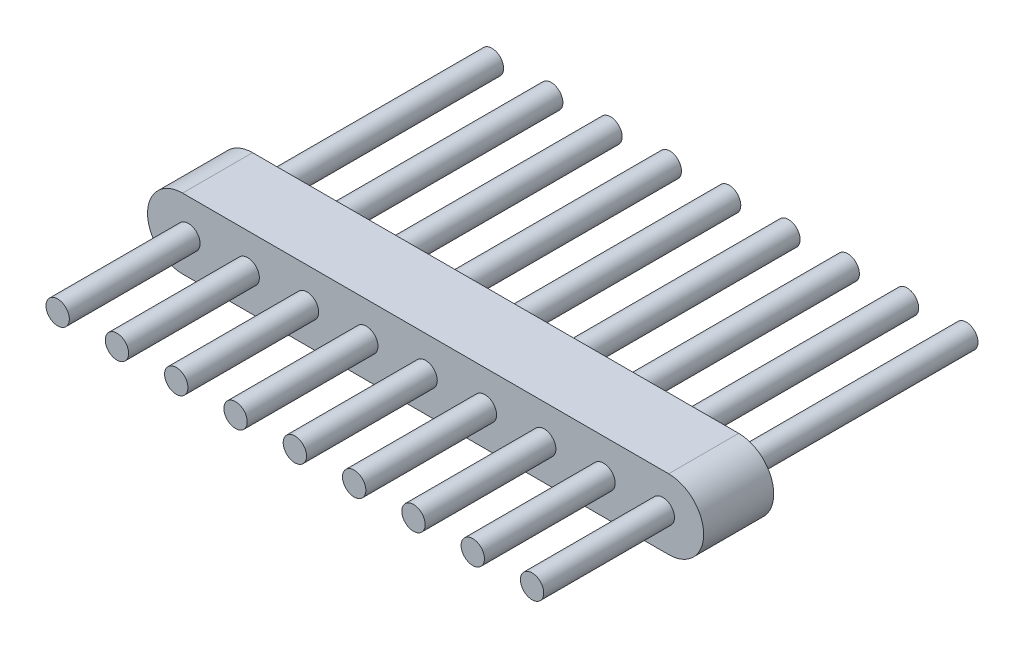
ISO-10303-21;
HEADER;
FILE_DESCRIPTION(('STEP AP214'),'2;1');
FILE_NAME('part.step','',(''),(''),'','','');
FILE_SCHEMA(('AUTOMOTIVE_DESIGN { 1 0 10303 214 1 1 1 1 }'));
ENDSEC;
DATA;
#1=APPLICATION_CONTEXT('core data for automotive mechanical design processes');
#2=APPLICATION_PROTOCOL_DEFINITION('international standard','automotive_design',2000,#1);
#3=PRODUCT_CONTEXT('',#1,'mechanical');
#4=PRODUCT('Part','Part','',(#3));
#5=PRODUCT_RELATED_PRODUCT_CATEGORY('part','',(#4));
#6=PRODUCT_DEFINITION_FORMATION('','',#4);
#7=PRODUCT_DEFINITION_CONTEXT('part definition',#1,'design');
#8=PRODUCT_DEFINITION('design','',#6,#7);
#9=PRODUCT_DEFINITION_SHAPE('','',#8);
#10=(LENGTH_UNIT() NAMED_UNIT(*) SI_UNIT(.MILLI.,.METRE.));
#11=(NAMED_UNIT(*) PLANE_ANGLE_UNIT() SI_UNIT($,.RADIAN.));
#12=(NAMED_UNIT(*) SI_UNIT($,.STERADIAN.) SOLID_ANGLE_UNIT());
#13=UNCERTAINTY_MEASURE_WITH_UNIT(LENGTH_MEASURE(1.E-05),#10,'distance_accuracy_value','');
#14=(GEOMETRIC_REPRESENTATION_CONTEXT(3) GLOBAL_UNCERTAINTY_ASSIGNED_CONTEXT((#13)) GLOBAL_UNIT_ASSIGNED_CONTEXT((#10,
#11,#12)) REPRESENTATION_CONTEXT('',''));
#15=CARTESIAN_POINT('',(0.,0.,0.));
#16=DIRECTION('',(0.,0.,1.));
#17=DIRECTION('',(1.,0.,0.));
#18=AXIS2_PLACEMENT_3D('',#15,#16,#17);
#19=CARTESIAN_POINT('',(125.878875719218,143.050518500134,0.));
#20=DIRECTION('',(0.,0.,1.));
#21=DIRECTION('',(1.,0.,0.));
#22=AXIS2_PLACEMENT_3D('',#19,#20,#21);
#23=PLANE('',#22);
#24=CARTESIAN_POINT('',(127.273875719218,143.050518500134,0.));
#25=DIRECTION('',(0.,0.,1.));
#26=DIRECTION('',(1.,0.,0.));
#27=AXIS2_PLACEMENT_3D('',#24,#25,#26);
#28=CIRCLE('',#27,0.250000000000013);
#29=CARTESIAN_POINT('',(127.523875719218,143.050518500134,0.));
#30=VERTEX_POINT('',#29);
#31=EDGE_CURVE('E44',#30,#30,#28,.F.);
#32=ORIENTED_EDGE('',*,*,#31,.F.);
#33=EDGE_LOOP('',(#32));
#34=FACE_BOUND('',#33,.T.);
#35=CARTESIAN_POINT('',(129.813875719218,143.050518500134,0.));
#36=DIRECTION('',(0.,0.,1.));
#37=DIRECTION('',(1.,0.,0.));
#38=AXIS2_PLACEMENT_3D('',#35,#36,#37);
#39=CIRCLE('',#38,0.250000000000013);
#40=CARTESIAN_POINT('',(130.063875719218,143.050518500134,0.));
#41=VERTEX_POINT('',#40);
#42=EDGE_CURVE('E129',#41,#41,#39,.F.);
#43=ORIENTED_EDGE('',*,*,#42,.F.);
#44=EDGE_LOOP('',(#43));
#45=FACE_BOUND('',#44,.T.);
#46=CARTESIAN_POINT('',(132.353875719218,143.050518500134,0.));
#47=DIRECTION('',(0.,0.,1.));
#48=DIRECTION('',(1.,0.,0.));
#49=AXIS2_PLACEMENT_3D('',#46,#47,#48);
#50=CIRCLE('',#49,0.250000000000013);
#51=CARTESIAN_POINT('',(132.603875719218,143.050518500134,0.));
#52=VERTEX_POINT('',#51);
#53=EDGE_CURVE('E123',#52,#52,#50,.F.);
#54=ORIENTED_EDGE('',*,*,#53,.F.);
#55=EDGE_LOOP('',(#54));
#56=FACE_BOUND('',#55,.T.);
#57=CARTESIAN_POINT('',(134.893875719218,143.050518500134,0.));
#58=DIRECTION('',(0.,0.,1.));
#59=DIRECTION('',(1.,0.,0.));
#60=AXIS2_PLACEMENT_3D('',#57,#58,#59);
#61=CIRCLE('',#60,0.249999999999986);
#62=CARTESIAN_POINT('',(135.143875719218,143.050518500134,0.));
#63=VERTEX_POINT('',#62);
#64=EDGE_CURVE('E117',#63,#63,#61,.F.);
#65=ORIENTED_EDGE('',*,*,#64,.F.);
#66=EDGE_LOOP('',(#65));
#67=FACE_BOUND('',#66,.T.);
#68=CARTESIAN_POINT('',(125.878875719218,143.050518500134,0.));
#69=DIRECTION('',(0.,0.,1.));
#70=DIRECTION('',(1.,0.,0.));
#71=AXIS2_PLACEMENT_3D('',#68,#69,#70);
#72=CIRCLE('',#71,0.750000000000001);
#73=CARTESIAN_POINT('',(125.878875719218,143.800518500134,0.));
#74=VERTEX_POINT('',#73);
#75=CARTESIAN_POINT('',(125.878875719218,142.300518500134,0.));
#76=VERTEX_POINT('',#75);
#77=EDGE_CURVE('E104',#74,#76,#72,.T.);
#78=ORIENTED_EDGE('',*,*,#77,.F.);
#79=DIRECTION('',(-1.,0.,0.));
#80=VECTOR('',#79,1.);
#81=CARTESIAN_POINT('',(125.878875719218,143.800518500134,0.));
#82=LINE('',#81,#80);
#83=CARTESIAN_POINT('',(136.288875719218,143.800518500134,0.));
#84=VERTEX_POINT('',#83);
#85=EDGE_CURVE('E75',#84,#74,#82,.T.);
#86=ORIENTED_EDGE('',*,*,#85,.F.);
#87=CARTESIAN_POINT('',(136.288875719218,143.050518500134,0.));
#88=DIRECTION('',(0.,0.,1.));
#89=DIRECTION('',(-1.,0.,0.));
#90=AXIS2_PLACEMENT_3D('',#87,#88,#89);
#91=CIRCLE('',#90,0.750000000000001);
#92=CARTESIAN_POINT('',(136.288875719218,142.300518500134,0.));
#93=VERTEX_POINT('',#92);
#94=EDGE_CURVE('E69',#93,#84,#91,.T.);
#95=ORIENTED_EDGE('',*,*,#94,.F.);
#96=DIRECTION('',(1.,0.,0.));
#97=VECTOR('',#96,1.);
#98=CARTESIAN_POINT('',(136.288875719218,142.300518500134,0.));
#99=LINE('',#98,#97);
#100=EDGE_CURVE('E94',#76,#93,#99,.T.);
#101=ORIENTED_EDGE('',*,*,#100,.F.);
#102=EDGE_LOOP('',(#78,#86,#95,#101));
#103=FACE_BOUND('',#102,.T.);
#104=CARTESIAN_POINT('',(136.163875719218,143.050518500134,0.));
#105=DIRECTION('',(0.,0.,1.));
#106=DIRECTION('',(1.,0.,0.));
#107=AXIS2_PLACEMENT_3D('',#104,#105,#106);
#108=CIRCLE('',#107,0.249999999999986);
#109=CARTESIAN_POINT('',(136.413875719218,143.050518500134,0.));
#110=VERTEX_POINT('',#109);
#111=EDGE_CURVE('E114',#110,#110,#108,.F.);
#112=ORIENTED_EDGE('',*,*,#111,.F.);
#113=EDGE_LOOP('',(#112));
#114=FACE_BOUND('',#113,.T.);
#115=CARTESIAN_POINT('',(133.623875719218,143.050518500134,0.));
#116=DIRECTION('',(0.,0.,1.));
#117=DIRECTION('',(1.,0.,0.));
#118=AXIS2_PLACEMENT_3D('',#115,#116,#117);
#119=CIRCLE('',#118,0.250000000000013);
#120=CARTESIAN_POINT('',(133.873875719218,143.050518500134,0.));
#121=VERTEX_POINT('',#120);
#122=EDGE_CURVE('E120',#121,#121,#119,.F.);
#123=ORIENTED_EDGE('',*,*,#122,.F.);
#124=EDGE_LOOP('',(#123));
#125=FACE_BOUND('',#124,.T.);
#126=CARTESIAN_POINT('',(131.083875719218,143.050518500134,0.));
#127=DIRECTION('',(0.,0.,1.));
#128=DIRECTION('',(1.,0.,0.));
#129=AXIS2_PLACEMENT_3D('',#126,#127,#128);
#130=CIRCLE('',#129,0.250000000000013);
#131=CARTESIAN_POINT('',(131.333875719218,143.050518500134,0.));
#132=VERTEX_POINT('',#131);
#133=EDGE_CURVE('E126',#132,#132,#130,.F.);
#134=ORIENTED_EDGE('',*,*,#133,.F.);
#135=EDGE_LOOP('',(#134));
#136=FACE_BOUND('',#135,.T.);
#137=CARTESIAN_POINT('',(128.543875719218,143.050518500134,0.));
#138=DIRECTION('',(0.,0.,1.));
#139=DIRECTION('',(1.,0.,0.));
#140=AXIS2_PLACEMENT_3D('',#137,#138,#139);
#141=CIRCLE('',#140,0.249999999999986);
#142=CARTESIAN_POINT('',(128.793875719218,143.050518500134,0.));
#143=VERTEX_POINT('',#142);
#144=EDGE_CURVE('E132',#143,#143,#141,.F.);
#145=ORIENTED_EDGE('',*,*,#144,.F.);
#146=EDGE_LOOP('',(#145));
#147=FACE_BOUND('',#146,.T.);
#148=CARTESIAN_POINT('',(126.003875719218,143.050518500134,0.));
#149=DIRECTION('',(0.,0.,1.));
#150=DIRECTION('',(1.,0.,0.));
#151=AXIS2_PLACEMENT_3D('',#148,#149,#150);
#152=CIRCLE('',#151,0.250000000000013);
#153=CARTESIAN_POINT('',(126.253875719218,143.050518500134,0.));
#154=VERTEX_POINT('',#153);
#155=EDGE_CURVE('E11',#154,#154,#152,.F.);
#156=ORIENTED_EDGE('',*,*,#155,.F.);
#157=EDGE_LOOP('',(#156));
#158=FACE_BOUND('',#157,.T.);
#159=ADVANCED_FACE('F35',(#34,#45,#56,#67,#103,#114,#125,#136,#147,#158),#23,.F.);
#160=CARTESIAN_POINT('',(125.878875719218,143.050518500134,1.5));
#161=DIRECTION('',(0.,0.,1.));
#162=DIRECTION('',(1.,0.,0.));
#163=AXIS2_PLACEMENT_3D('',#160,#161,#162);
#164=PLANE('',#163);
#165=CARTESIAN_POINT('',(134.893875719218,143.050518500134,1.5));
#166=DIRECTION('',(0.,0.,1.));
#167=DIRECTION('',(1.,0.,0.));
#168=AXIS2_PLACEMENT_3D('',#165,#166,#167);
#169=CIRCLE('',#168,0.250000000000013);
#170=CARTESIAN_POINT('',(135.143875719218,143.050518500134,1.5));
#171=VERTEX_POINT('',#170);
#172=EDGE_CURVE('E364',#171,#171,#169,.T.);
#173=ORIENTED_EDGE('',*,*,#172,.F.);
#174=EDGE_LOOP('',(#173));
#175=FACE_BOUND('',#174,.T.);
#176=CARTESIAN_POINT('',(132.353875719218,143.050518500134,1.5));
#177=DIRECTION('',(0.,0.,1.));
#178=DIRECTION('',(1.,0.,0.));
#179=AXIS2_PLACEMENT_3D('',#176,#177,#178);
#180=CIRCLE('',#179,0.250000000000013);
#181=CARTESIAN_POINT('',(132.603875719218,143.050518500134,1.5));
#182=VERTEX_POINT('',#181);
#183=EDGE_CURVE('E352',#182,#182,#180,.T.);
#184=ORIENTED_EDGE('',*,*,#183,.F.);
#185=EDGE_LOOP('',(#184));
#186=FACE_BOUND('',#185,.T.);
#187=CARTESIAN_POINT('',(129.813875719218,143.050518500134,1.5));
#188=DIRECTION('',(0.,0.,1.));
#189=DIRECTION('',(1.,0.,0.));
#190=AXIS2_PLACEMENT_3D('',#187,#188,#189);
#191=CIRCLE('',#190,0.249999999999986);
#192=CARTESIAN_POINT('',(130.063875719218,143.050518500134,1.5));
#193=VERTEX_POINT('',#192);
#194=EDGE_CURVE('E340',#193,#193,#191,.T.);
#195=ORIENTED_EDGE('',*,*,#194,.F.);
#196=EDGE_LOOP('',(#195));
#197=FACE_BOUND('',#196,.T.);
#198=CARTESIAN_POINT('',(127.273875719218,143.050518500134,1.5));
#199=DIRECTION('',(0.,0.,1.));
#200=DIRECTION('',(1.,0.,0.));
#201=AXIS2_PLACEMENT_3D('',#198,#199,#200);
#202=CIRCLE('',#201,0.250000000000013);
#203=CARTESIAN_POINT('',(127.523875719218,143.050518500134,1.5));
#204=VERTEX_POINT('',#203);
#205=EDGE_CURVE('E328',#204,#204,#202,.T.);
#206=ORIENTED_EDGE('',*,*,#205,.F.);
#207=EDGE_LOOP('',(#206));
#208=FACE_BOUND('',#207,.T.);
#209=CARTESIAN_POINT('',(125.878875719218,143.050518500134,1.5));
#210=DIRECTION('',(0.,0.,1.));
#211=DIRECTION('',(1.,0.,0.));
#212=AXIS2_PLACEMENT_3D('',#209,#210,#211);
#213=CIRCLE('',#212,0.750000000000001);
#214=CARTESIAN_POINT('',(125.878875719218,143.800518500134,1.5));
#215=VERTEX_POINT('',#214);
#216=CARTESIAN_POINT('',(125.878875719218,142.300518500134,1.5));
#217=VERTEX_POINT('',#216);
#218=EDGE_CURVE('E89',#215,#217,#213,.T.);
#219=ORIENTED_EDGE('',*,*,#218,.T.);
#220=DIRECTION('',(1.,0.,0.));
#221=VECTOR('',#220,1.);
#222=CARTESIAN_POINT('',(136.288875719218,142.300518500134,1.5));
#223=LINE('',#222,#221);
#224=CARTESIAN_POINT('',(136.288875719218,142.300518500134,1.5));
#225=VERTEX_POINT('',#224);
#226=EDGE_CURVE('E83',#217,#225,#223,.T.);
#227=ORIENTED_EDGE('',*,*,#226,.T.);
#228=CARTESIAN_POINT('',(136.288875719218,143.050518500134,1.5));
#229=DIRECTION('',(0.,0.,1.));
#230=DIRECTION('',(-1.,0.,0.));
#231=AXIS2_PLACEMENT_3D('',#228,#229,#230);
#232=CIRCLE('',#231,0.750000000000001);
#233=CARTESIAN_POINT('',(136.288875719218,143.800518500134,1.5));
#234=VERTEX_POINT('',#233);
#235=EDGE_CURVE('E87',#225,#234,#232,.T.);
#236=ORIENTED_EDGE('',*,*,#235,.T.);
#237=DIRECTION('',(-1.,0.,0.));
#238=VECTOR('',#237,1.);
#239=CARTESIAN_POINT('',(125.878875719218,143.800518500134,1.5));
#240=LINE('',#239,#238);
#241=EDGE_CURVE('E52',#234,#215,#240,.T.);
#242=ORIENTED_EDGE('',*,*,#241,.T.);
#243=EDGE_LOOP('',(#219,#227,#236,#242));
#244=FACE_BOUND('',#243,.T.);
#245=CARTESIAN_POINT('',(126.003875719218,143.050518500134,1.5));
#246=DIRECTION('',(0.,0.,1.));
#247=DIRECTION('',(1.,0.,0.));
#248=AXIS2_PLACEMENT_3D('',#245,#246,#247);
#249=CIRCLE('',#248,0.249999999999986);
#250=CARTESIAN_POINT('',(126.253875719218,143.050518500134,1.5));
#251=VERTEX_POINT('',#250);
#252=EDGE_CURVE('E322',#251,#251,#249,.T.);
#253=ORIENTED_EDGE('',*,*,#252,.F.);
#254=EDGE_LOOP('',(#253));
#255=FACE_BOUND('',#254,.T.);
#256=CARTESIAN_POINT('',(128.543875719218,143.050518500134,1.5));
#257=DIRECTION('',(0.,0.,1.));
#258=DIRECTION('',(1.,0.,0.));
#259=AXIS2_PLACEMENT_3D('',#256,#257,#258);
#260=CIRCLE('',#259,0.24999999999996);
#261=CARTESIAN_POINT('',(128.793875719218,143.050518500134,1.5));
#262=VERTEX_POINT('',#261);
#263=EDGE_CURVE('E334',#262,#262,#260,.T.);
#264=ORIENTED_EDGE('',*,*,#263,.F.);
#265=EDGE_LOOP('',(#264));
#266=FACE_BOUND('',#265,.T.);
#267=CARTESIAN_POINT('',(131.083875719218,143.050518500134,1.5));
#268=DIRECTION('',(0.,0.,1.));
#269=DIRECTION('',(1.,0.,0.));
#270=AXIS2_PLACEMENT_3D('',#267,#268,#269);
#271=CIRCLE('',#270,0.249999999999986);
#272=CARTESIAN_POINT('',(131.333875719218,143.050518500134,1.5));
#273=VERTEX_POINT('',#272);
#274=EDGE_CURVE('E346',#273,#273,#271,.T.);
#275=ORIENTED_EDGE('',*,*,#274,.F.);
#276=EDGE_LOOP('',(#275));
#277=FACE_BOUND('',#276,.T.);
#278=CARTESIAN_POINT('',(133.623875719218,143.050518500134,1.5));
#279=DIRECTION('',(0.,0.,1.));
#280=DIRECTION('',(1.,0.,0.));
#281=AXIS2_PLACEMENT_3D('',#278,#279,#280);
#282=CIRCLE('',#281,0.250000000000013);
#283=CARTESIAN_POINT('',(133.873875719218,143.050518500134,1.5));
#284=VERTEX_POINT('',#283);
#285=EDGE_CURVE('E358',#284,#284,#282,.T.);
#286=ORIENTED_EDGE('',*,*,#285,.F.);
#287=EDGE_LOOP('',(#286));
#288=FACE_BOUND('',#287,.T.);
#289=CARTESIAN_POINT('',(136.163875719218,143.050518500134,1.5));
#290=DIRECTION('',(0.,0.,1.));
#291=DIRECTION('',(1.,0.,0.));
#292=AXIS2_PLACEMENT_3D('',#289,#290,#291);
#293=CIRCLE('',#292,0.249999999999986);
#294=CARTESIAN_POINT('',(136.413875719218,143.050518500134,1.5));
#295=VERTEX_POINT('',#294);
#296=EDGE_CURVE('E370',#295,#295,#293,.T.);
#297=ORIENTED_EDGE('',*,*,#296,.F.);
#298=EDGE_LOOP('',(#297));
#299=FACE_BOUND('',#298,.T.);
#300=ADVANCED_FACE('F84',(#175,#186,#197,#208,#244,#255,#266,#277,#288,#299),#164,.T.);
#301=CARTESIAN_POINT('',(125.878875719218,143.050518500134,1.5));
#302=DIRECTION('',(0.,0.,-1.));
#303=DIRECTION('',(-1.,0.,0.));
#304=AXIS2_PLACEMENT_3D('',#301,#302,#303);
#305=CYLINDRICAL_SURFACE('',#304,0.750000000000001);
#306=ORIENTED_EDGE('',*,*,#77,.T.);
#307=DIRECTION('',(0.,0.,-1.));
#308=VECTOR('',#307,1.);
#309=CARTESIAN_POINT('',(125.878875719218,142.300518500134,1.5));
#310=LINE('',#309,#308);
#311=EDGE_CURVE('E95',#217,#76,#310,.T.);
#312=ORIENTED_EDGE('',*,*,#311,.F.);
#313=ORIENTED_EDGE('',*,*,#218,.F.);
#314=DIRECTION('',(0.,0.,-1.));
#315=VECTOR('',#314,1.);
#316=CARTESIAN_POINT('',(125.878875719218,143.800518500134,1.5));
#317=LINE('',#316,#315);
#318=EDGE_CURVE('E100',#215,#74,#317,.T.);
#319=ORIENTED_EDGE('',*,*,#318,.T.);
#320=EDGE_LOOP('',(#306,#312,#313,#319));
#321=FACE_BOUND('',#320,.T.);
#322=ADVANCED_FACE('F37',(#321),#305,.T.);
#323=CARTESIAN_POINT('',(136.288875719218,142.300518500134,1.5));
#324=DIRECTION('',(0.,1.,0.));
#325=DIRECTION('',(0.,0.,1.));
#326=AXIS2_PLACEMENT_3D('',#323,#324,#325);
#327=PLANE('',#326);
#328=ORIENTED_EDGE('',*,*,#100,.T.);
#329=DIRECTION('',(0.,0.,-1.));
#330=VECTOR('',#329,1.);
#331=CARTESIAN_POINT('',(136.288875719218,142.300518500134,1.5));
#332=LINE('',#331,#330);
#333=EDGE_CURVE('E92',#225,#93,#332,.T.);
#334=ORIENTED_EDGE('',*,*,#333,.F.);
#335=ORIENTED_EDGE('',*,*,#226,.F.);
#336=ORIENTED_EDGE('',*,*,#311,.T.);
#337=EDGE_LOOP('',(#328,#334,#335,#336));
#338=FACE_BOUND('',#337,.T.);
#339=ADVANCED_FACE('F93',(#338),#327,.F.);
#340=CARTESIAN_POINT('',(136.288875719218,143.050518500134,1.5));
#341=DIRECTION('',(0.,0.,-1.));
#342=DIRECTION('',(-1.,0.,0.));
#343=AXIS2_PLACEMENT_3D('',#340,#341,#342);
#344=CYLINDRICAL_SURFACE('',#343,0.750000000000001);
#345=ORIENTED_EDGE('',*,*,#94,.T.);
#346=DIRECTION('',(0.,0.,-1.));
#347=VECTOR('',#346,1.);
#348=CARTESIAN_POINT('',(136.288875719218,143.800518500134,1.5));
#349=LINE('',#348,#347);
#350=EDGE_CURVE('E96',#234,#84,#349,.T.);
#351=ORIENTED_EDGE('',*,*,#350,.F.);
#352=ORIENTED_EDGE('',*,*,#235,.F.);
#353=ORIENTED_EDGE('',*,*,#333,.T.);
#354=EDGE_LOOP('',(#345,#351,#352,#353));
#355=FACE_BOUND('',#354,.T.);
#356=ADVANCED_FACE('F98',(#355),#344,.T.);
#357=CARTESIAN_POINT('',(125.878875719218,143.800518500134,1.5));
#358=DIRECTION('',(0.,-1.,0.));
#359=DIRECTION('',(0.,0.,-1.));
#360=AXIS2_PLACEMENT_3D('',#357,#358,#359);
#361=PLANE('',#360);
#362=ORIENTED_EDGE('',*,*,#85,.T.);
#363=ORIENTED_EDGE('',*,*,#318,.F.);
#364=ORIENTED_EDGE('',*,*,#241,.F.);
#365=ORIENTED_EDGE('',*,*,#350,.T.);
#366=EDGE_LOOP('',(#362,#363,#364,#365));
#367=FACE_BOUND('',#366,.T.);
#368=ADVANCED_FACE('F306',(#367),#361,.F.);
#369=CARTESIAN_POINT('',(126.003875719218,143.050518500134,4.3));
#370=DIRECTION('',(0.,0.,-1.));
#371=DIRECTION('',(-1.,0.,0.));
#372=AXIS2_PLACEMENT_3D('',#369,#370,#371);
#373=CYLINDRICAL_SURFACE('',#372,0.249999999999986);
#374=CARTESIAN_POINT('',(126.003875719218,143.050518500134,4.3));
#375=DIRECTION('',(0.,0.,1.));
#376=DIRECTION('',(1.,0.,0.));
#377=AXIS2_PLACEMENT_3D('',#374,#375,#376);
#378=CIRCLE('',#377,0.249999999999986);
#379=CARTESIAN_POINT('',(126.253875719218,143.050518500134,4.3));
#380=VERTEX_POINT('',#379);
#381=EDGE_CURVE('E107',#380,#380,#378,.T.);
#382=ORIENTED_EDGE('',*,*,#381,.F.);
#383=EDGE_LOOP('',(#382));
#384=FACE_BOUND('',#383,.T.);
#385=ORIENTED_EDGE('',*,*,#252,.T.);
#386=EDGE_LOOP('',(#385));
#387=FACE_BOUND('',#386,.T.);
#388=ADVANCED_FACE('F302',(#384,#387),#373,.T.);
#389=CARTESIAN_POINT('',(126.003875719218,143.050518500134,4.3));
#390=DIRECTION('',(0.,0.,1.));
#391=DIRECTION('',(1.,0.,0.));
#392=AXIS2_PLACEMENT_3D('',#389,#390,#391);
#393=PLANE('',#392);
#394=ORIENTED_EDGE('',*,*,#381,.T.);
#395=EDGE_LOOP('',(#394));
#396=FACE_BOUND('',#395,.T.);
#397=ADVANCED_FACE('F298',(#396),#393,.T.);
#398=CARTESIAN_POINT('',(127.273875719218,143.050518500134,4.3));
#399=DIRECTION('',(0.,0.,-1.));
#400=DIRECTION('',(-1.,0.,0.));
#401=AXIS2_PLACEMENT_3D('',#398,#399,#400);
#402=CYLINDRICAL_SURFACE('',#401,0.250000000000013);
#403=CARTESIAN_POINT('',(127.273875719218,143.050518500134,4.3));
#404=DIRECTION('',(0.,0.,1.));
#405=DIRECTION('',(1.,0.,0.));
#406=AXIS2_PLACEMENT_3D('',#403,#404,#405);
#407=CIRCLE('',#406,0.250000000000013);
#408=CARTESIAN_POINT('',(127.523875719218,143.050518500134,4.3));
#409=VERTEX_POINT('',#408);
#410=EDGE_CURVE('E325',#409,#409,#407,.T.);
#411=ORIENTED_EDGE('',*,*,#410,.F.);
#412=EDGE_LOOP('',(#411));
#413=FACE_BOUND('',#412,.T.);
#414=ORIENTED_EDGE('',*,*,#205,.T.);
#415=EDGE_LOOP('',(#414));
#416=FACE_BOUND('',#415,.T.);
#417=ADVANCED_FACE('F294',(#413,#416),#402,.T.);
#418=CARTESIAN_POINT('',(127.273875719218,143.050518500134,4.3));
#419=DIRECTION('',(0.,0.,1.));
#420=DIRECTION('',(1.,0.,0.));
#421=AXIS2_PLACEMENT_3D('',#418,#419,#420);
#422=PLANE('',#421);
#423=ORIENTED_EDGE('',*,*,#410,.T.);
#424=EDGE_LOOP('',(#423));
#425=FACE_BOUND('',#424,.T.);
#426=ADVANCED_FACE('F290',(#425),#422,.T.);
#427=CARTESIAN_POINT('',(128.543875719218,143.050518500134,4.3));
#428=DIRECTION('',(0.,0.,-1.));
#429=DIRECTION('',(-1.,0.,0.));
#430=AXIS2_PLACEMENT_3D('',#427,#428,#429);
#431=CYLINDRICAL_SURFACE('',#430,0.24999999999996);
#432=CARTESIAN_POINT('',(128.543875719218,143.050518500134,4.3));
#433=DIRECTION('',(0.,0.,1.));
#434=DIRECTION('',(1.,0.,0.));
#435=AXIS2_PLACEMENT_3D('',#432,#433,#434);
#436=CIRCLE('',#435,0.24999999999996);
#437=CARTESIAN_POINT('',(128.793875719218,143.050518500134,4.3));
#438=VERTEX_POINT('',#437);
#439=EDGE_CURVE('E331',#438,#438,#436,.T.);
#440=ORIENTED_EDGE('',*,*,#439,.F.);
#441=EDGE_LOOP('',(#440));
#442=FACE_BOUND('',#441,.T.);
#443=ORIENTED_EDGE('',*,*,#263,.T.);
#444=EDGE_LOOP('',(#443));
#445=FACE_BOUND('',#444,.T.);
#446=ADVANCED_FACE('F286',(#442,#445),#431,.T.);
#447=CARTESIAN_POINT('',(128.543875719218,143.050518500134,4.3));
#448=DIRECTION('',(0.,0.,1.));
#449=DIRECTION('',(1.,0.,0.));
#450=AXIS2_PLACEMENT_3D('',#447,#448,#449);
#451=PLANE('',#450);
#452=ORIENTED_EDGE('',*,*,#439,.T.);
#453=EDGE_LOOP('',(#452));
#454=FACE_BOUND('',#453,.T.);
#455=ADVANCED_FACE('F282',(#454),#451,.T.);
#456=CARTESIAN_POINT('',(129.813875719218,143.050518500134,4.3));
#457=DIRECTION('',(0.,0.,-1.));
#458=DIRECTION('',(-1.,0.,0.));
#459=AXIS2_PLACEMENT_3D('',#456,#457,#458);
#460=CYLINDRICAL_SURFACE('',#459,0.249999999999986);
#461=CARTESIAN_POINT('',(129.813875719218,143.050518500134,4.3));
#462=DIRECTION('',(0.,0.,1.));
#463=DIRECTION('',(1.,0.,0.));
#464=AXIS2_PLACEMENT_3D('',#461,#462,#463);
#465=CIRCLE('',#464,0.249999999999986);
#466=CARTESIAN_POINT('',(130.063875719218,143.050518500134,4.3));
#467=VERTEX_POINT('',#466);
#468=EDGE_CURVE('E337',#467,#467,#465,.T.);
#469=ORIENTED_EDGE('',*,*,#468,.F.);
#470=EDGE_LOOP('',(#469));
#471=FACE_BOUND('',#470,.T.);
#472=ORIENTED_EDGE('',*,*,#194,.T.);
#473=EDGE_LOOP('',(#472));
#474=FACE_BOUND('',#473,.T.);
#475=ADVANCED_FACE('F278',(#471,#474),#460,.T.);
#476=CARTESIAN_POINT('',(129.813875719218,143.050518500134,4.3));
#477=DIRECTION('',(0.,0.,1.));
#478=DIRECTION('',(1.,0.,0.));
#479=AXIS2_PLACEMENT_3D('',#476,#477,#478);
#480=PLANE('',#479);
#481=ORIENTED_EDGE('',*,*,#468,.T.);
#482=EDGE_LOOP('',(#481));
#483=FACE_BOUND('',#482,.T.);
#484=ADVANCED_FACE('F274',(#483),#480,.T.);
#485=CARTESIAN_POINT('',(131.083875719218,143.050518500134,4.3));
#486=DIRECTION('',(0.,0.,-1.));
#487=DIRECTION('',(-1.,0.,0.));
#488=AXIS2_PLACEMENT_3D('',#485,#486,#487);
#489=CYLINDRICAL_SURFACE('',#488,0.249999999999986);
#490=CARTESIAN_POINT('',(131.083875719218,143.050518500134,4.3));
#491=DIRECTION('',(0.,0.,1.));
#492=DIRECTION('',(1.,0.,0.));
#493=AXIS2_PLACEMENT_3D('',#490,#491,#492);
#494=CIRCLE('',#493,0.249999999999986);
#495=CARTESIAN_POINT('',(131.333875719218,143.050518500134,4.3));
#496=VERTEX_POINT('',#495);
#497=EDGE_CURVE('E343',#496,#496,#494,.T.);
#498=ORIENTED_EDGE('',*,*,#497,.F.);
#499=EDGE_LOOP('',(#498));
#500=FACE_BOUND('',#499,.T.);
#501=ORIENTED_EDGE('',*,*,#274,.T.);
#502=EDGE_LOOP('',(#501));
#503=FACE_BOUND('',#502,.T.);
#504=ADVANCED_FACE('F270',(#500,#503),#489,.T.);
#505=CARTESIAN_POINT('',(131.083875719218,143.050518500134,4.3));
#506=DIRECTION('',(0.,0.,1.));
#507=DIRECTION('',(1.,0.,0.));
#508=AXIS2_PLACEMENT_3D('',#505,#506,#507);
#509=PLANE('',#508);
#510=ORIENTED_EDGE('',*,*,#497,.T.);
#511=EDGE_LOOP('',(#510));
#512=FACE_BOUND('',#511,.T.);
#513=ADVANCED_FACE('F266',(#512),#509,.T.);
#514=CARTESIAN_POINT('',(132.353875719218,143.050518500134,4.3));
#515=DIRECTION('',(0.,0.,-1.));
#516=DIRECTION('',(-1.,0.,0.));
#517=AXIS2_PLACEMENT_3D('',#514,#515,#516);
#518=CYLINDRICAL_SURFACE('',#517,0.250000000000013);
#519=CARTESIAN_POINT('',(132.353875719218,143.050518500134,4.3));
#520=DIRECTION('',(0.,0.,1.));
#521=DIRECTION('',(1.,0.,0.));
#522=AXIS2_PLACEMENT_3D('',#519,#520,#521);
#523=CIRCLE('',#522,0.250000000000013);
#524=CARTESIAN_POINT('',(132.603875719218,143.050518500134,4.3));
#525=VERTEX_POINT('',#524);
#526=EDGE_CURVE('E349',#525,#525,#523,.T.);
#527=ORIENTED_EDGE('',*,*,#526,.F.);
#528=EDGE_LOOP('',(#527));
#529=FACE_BOUND('',#528,.T.);
#530=ORIENTED_EDGE('',*,*,#183,.T.);
#531=EDGE_LOOP('',(#530));
#532=FACE_BOUND('',#531,.T.);
#533=ADVANCED_FACE('F262',(#529,#532),#518,.T.);
#534=CARTESIAN_POINT('',(132.353875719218,143.050518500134,4.3));
#535=DIRECTION('',(0.,0.,1.));
#536=DIRECTION('',(1.,0.,0.));
#537=AXIS2_PLACEMENT_3D('',#534,#535,#536);
#538=PLANE('',#537);
#539=ORIENTED_EDGE('',*,*,#526,.T.);
#540=EDGE_LOOP('',(#539));
#541=FACE_BOUND('',#540,.T.);
#542=ADVANCED_FACE('F258',(#541),#538,.T.);
#543=CARTESIAN_POINT('',(133.623875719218,143.050518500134,4.3));
#544=DIRECTION('',(0.,0.,-1.));
#545=DIRECTION('',(-1.,0.,0.));
#546=AXIS2_PLACEMENT_3D('',#543,#544,#545);
#547=CYLINDRICAL_SURFACE('',#546,0.250000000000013);
#548=CARTESIAN_POINT('',(133.623875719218,143.050518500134,4.3));
#549=DIRECTION('',(0.,0.,1.));
#550=DIRECTION('',(1.,0.,0.));
#551=AXIS2_PLACEMENT_3D('',#548,#549,#550);
#552=CIRCLE('',#551,0.250000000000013);
#553=CARTESIAN_POINT('',(133.873875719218,143.050518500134,4.3));
#554=VERTEX_POINT('',#553);
#555=EDGE_CURVE('E355',#554,#554,#552,.T.);
#556=ORIENTED_EDGE('',*,*,#555,.F.);
#557=EDGE_LOOP('',(#556));
#558=FACE_BOUND('',#557,.T.);
#559=ORIENTED_EDGE('',*,*,#285,.T.);
#560=EDGE_LOOP('',(#559));
#561=FACE_BOUND('',#560,.T.);
#562=ADVANCED_FACE('F254',(#558,#561),#547,.T.);
#563=CARTESIAN_POINT('',(133.623875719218,143.050518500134,4.3));
#564=DIRECTION('',(0.,0.,1.));
#565=DIRECTION('',(1.,0.,0.));
#566=AXIS2_PLACEMENT_3D('',#563,#564,#565);
#567=PLANE('',#566);
#568=ORIENTED_EDGE('',*,*,#555,.T.);
#569=EDGE_LOOP('',(#568));
#570=FACE_BOUND('',#569,.T.);
#571=ADVANCED_FACE('F250',(#570),#567,.T.);
#572=CARTESIAN_POINT('',(134.893875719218,143.050518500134,4.3));
#573=DIRECTION('',(0.,0.,-1.));
#574=DIRECTION('',(-1.,0.,0.));
#575=AXIS2_PLACEMENT_3D('',#572,#573,#574);
#576=CYLINDRICAL_SURFACE('',#575,0.250000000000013);
#577=CARTESIAN_POINT('',(134.893875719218,143.050518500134,4.3));
#578=DIRECTION('',(0.,0.,1.));
#579=DIRECTION('',(1.,0.,0.));
#580=AXIS2_PLACEMENT_3D('',#577,#578,#579);
#581=CIRCLE('',#580,0.250000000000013);
#582=CARTESIAN_POINT('',(135.143875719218,143.050518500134,4.3));
#583=VERTEX_POINT('',#582);
#584=EDGE_CURVE('E361',#583,#583,#581,.T.);
#585=ORIENTED_EDGE('',*,*,#584,.F.);
#586=EDGE_LOOP('',(#585));
#587=FACE_BOUND('',#586,.T.);
#588=ORIENTED_EDGE('',*,*,#172,.T.);
#589=EDGE_LOOP('',(#588));
#590=FACE_BOUND('',#589,.T.);
#591=ADVANCED_FACE('F246',(#587,#590),#576,.T.);
#592=CARTESIAN_POINT('',(134.893875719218,143.050518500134,4.3));
#593=DIRECTION('',(0.,0.,1.));
#594=DIRECTION('',(1.,0.,0.));
#595=AXIS2_PLACEMENT_3D('',#592,#593,#594);
#596=PLANE('',#595);
#597=ORIENTED_EDGE('',*,*,#584,.T.);
#598=EDGE_LOOP('',(#597));
#599=FACE_BOUND('',#598,.T.);
#600=ADVANCED_FACE('F242',(#599),#596,.T.);
#601=CARTESIAN_POINT('',(136.163875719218,143.050518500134,4.3));
#602=DIRECTION('',(0.,0.,-1.));
#603=DIRECTION('',(-1.,0.,0.));
#604=AXIS2_PLACEMENT_3D('',#601,#602,#603);
#605=CYLINDRICAL_SURFACE('',#604,0.249999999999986);
#606=CARTESIAN_POINT('',(136.163875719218,143.050518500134,4.3));
#607=DIRECTION('',(0.,0.,1.));
#608=DIRECTION('',(1.,0.,0.));
#609=AXIS2_PLACEMENT_3D('',#606,#607,#608);
#610=CIRCLE('',#609,0.249999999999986);
#611=CARTESIAN_POINT('',(136.413875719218,143.050518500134,4.3));
#612=VERTEX_POINT('',#611);
#613=EDGE_CURVE('E367',#612,#612,#610,.T.);
#614=ORIENTED_EDGE('',*,*,#613,.F.);
#615=EDGE_LOOP('',(#614));
#616=FACE_BOUND('',#615,.T.);
#617=ORIENTED_EDGE('',*,*,#296,.T.);
#618=EDGE_LOOP('',(#617));
#619=FACE_BOUND('',#618,.T.);
#620=ADVANCED_FACE('F238',(#616,#619),#605,.T.);
#621=CARTESIAN_POINT('',(136.163875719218,143.050518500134,4.3));
#622=DIRECTION('',(0.,0.,1.));
#623=DIRECTION('',(1.,0.,0.));
#624=AXIS2_PLACEMENT_3D('',#621,#622,#623);
#625=PLANE('',#624);
#626=ORIENTED_EDGE('',*,*,#613,.T.);
#627=EDGE_LOOP('',(#626));
#628=FACE_BOUND('',#627,.T.);
#629=ADVANCED_FACE('F234',(#628),#625,.T.);
#630=CARTESIAN_POINT('',(136.163875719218,143.050518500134,-5.));
#631=DIRECTION('',(0.,0.,1.));
#632=DIRECTION('',(1.,0.,0.));
#633=AXIS2_PLACEMENT_3D('',#630,#631,#632);
#634=CYLINDRICAL_SURFACE('',#633,0.249999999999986);
#635=CARTESIAN_POINT('',(136.163875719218,143.050518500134,-5.));
#636=DIRECTION('',(0.,0.,-1.));
#637=DIRECTION('',(-1.,0.,0.));
#638=AXIS2_PLACEMENT_3D('',#635,#636,#637);
#639=CIRCLE('',#638,0.249999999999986);
#640=CARTESIAN_POINT('',(135.913875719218,143.050518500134,-5.));
#641=VERTEX_POINT('',#640);
#642=EDGE_CURVE('E373',#641,#641,#639,.T.);
#643=ORIENTED_EDGE('',*,*,#642,.F.);
#644=EDGE_LOOP('',(#643));
#645=FACE_BOUND('',#644,.T.);
#646=ORIENTED_EDGE('',*,*,#111,.T.);
#647=EDGE_LOOP('',(#646));
#648=FACE_BOUND('',#647,.T.);
#649=ADVANCED_FACE('F230',(#645,#648),#634,.T.);
#650=CARTESIAN_POINT('',(136.163875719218,143.050518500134,-5.));
#651=DIRECTION('',(0.,0.,-1.));
#652=DIRECTION('',(-1.,0.,0.));
#653=AXIS2_PLACEMENT_3D('',#650,#651,#652);
#654=PLANE('',#653);
#655=ORIENTED_EDGE('',*,*,#642,.T.);
#656=EDGE_LOOP('',(#655));
#657=FACE_BOUND('',#656,.T.);
#658=ADVANCED_FACE('F226',(#657),#654,.T.);
#659=CARTESIAN_POINT('',(134.893875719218,143.050518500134,-5.));
#660=DIRECTION('',(0.,0.,1.));
#661=DIRECTION('',(1.,0.,0.));
#662=AXIS2_PLACEMENT_3D('',#659,#660,#661);
#663=CYLINDRICAL_SURFACE('',#662,0.249999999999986);
#664=CARTESIAN_POINT('',(134.893875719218,143.050518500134,-5.));
#665=DIRECTION('',(0.,0.,-1.));
#666=DIRECTION('',(-1.,0.,0.));
#667=AXIS2_PLACEMENT_3D('',#664,#665,#666);
#668=CIRCLE('',#667,0.249999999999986);
#669=CARTESIAN_POINT('',(134.643875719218,143.050518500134,-5.));
#670=VERTEX_POINT('',#669);
#671=EDGE_CURVE('E378',#670,#670,#668,.T.);
#672=ORIENTED_EDGE('',*,*,#671,.F.);
#673=EDGE_LOOP('',(#672));
#674=FACE_BOUND('',#673,.T.);
#675=ORIENTED_EDGE('',*,*,#64,.T.);
#676=EDGE_LOOP('',(#675));
#677=FACE_BOUND('',#676,.T.);
#678=ADVANCED_FACE('F222',(#674,#677),#663,.T.);
#679=CARTESIAN_POINT('',(134.893875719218,143.050518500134,-5.));
#680=DIRECTION('',(0.,0.,-1.));
#681=DIRECTION('',(-1.,0.,0.));
#682=AXIS2_PLACEMENT_3D('',#679,#680,#681);
#683=PLANE('',#682);
#684=ORIENTED_EDGE('',*,*,#671,.T.);
#685=EDGE_LOOP('',(#684));
#686=FACE_BOUND('',#685,.T.);
#687=ADVANCED_FACE('F218',(#686),#683,.T.);
#688=CARTESIAN_POINT('',(133.623875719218,143.050518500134,-5.));
#689=DIRECTION('',(0.,0.,1.));
#690=DIRECTION('',(1.,0.,0.));
#691=AXIS2_PLACEMENT_3D('',#688,#689,#690);
#692=CYLINDRICAL_SURFACE('',#691,0.250000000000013);
#693=CARTESIAN_POINT('',(133.623875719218,143.050518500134,-5.));
#694=DIRECTION('',(0.,0.,-1.));
#695=DIRECTION('',(-1.,0.,0.));
#696=AXIS2_PLACEMENT_3D('',#693,#694,#695);
#697=CIRCLE('',#696,0.250000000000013);
#698=CARTESIAN_POINT('',(133.373875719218,143.050518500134,-5.));
#699=VERTEX_POINT('',#698);
#700=EDGE_CURVE('E381',#699,#699,#697,.T.);
#701=ORIENTED_EDGE('',*,*,#700,.F.);
#702=EDGE_LOOP('',(#701));
#703=FACE_BOUND('',#702,.T.);
#704=ORIENTED_EDGE('',*,*,#122,.T.);
#705=EDGE_LOOP('',(#704));
#706=FACE_BOUND('',#705,.T.);
#707=ADVANCED_FACE('F214',(#703,#706),#692,.T.);
#708=CARTESIAN_POINT('',(133.623875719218,143.050518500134,-5.));
#709=DIRECTION('',(0.,0.,-1.));
#710=DIRECTION('',(-1.,0.,0.));
#711=AXIS2_PLACEMENT_3D('',#708,#709,#710);
#712=PLANE('',#711);
#713=ORIENTED_EDGE('',*,*,#700,.T.);
#714=EDGE_LOOP('',(#713));
#715=FACE_BOUND('',#714,.T.);
#716=ADVANCED_FACE('F210',(#715),#712,.T.);
#717=CARTESIAN_POINT('',(132.353875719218,143.050518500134,-5.));
#718=DIRECTION('',(0.,0.,1.));
#719=DIRECTION('',(1.,0.,0.));
#720=AXIS2_PLACEMENT_3D('',#717,#718,#719);
#721=CYLINDRICAL_SURFACE('',#720,0.250000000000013);
#722=CARTESIAN_POINT('',(132.353875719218,143.050518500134,-5.));
#723=DIRECTION('',(0.,0.,-1.));
#724=DIRECTION('',(-1.,0.,0.));
#725=AXIS2_PLACEMENT_3D('',#722,#723,#724);
#726=CIRCLE('',#725,0.250000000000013);
#727=CARTESIAN_POINT('',(132.103875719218,143.050518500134,-5.));
#728=VERTEX_POINT('',#727);
#729=EDGE_CURVE('E384',#728,#728,#726,.T.);
#730=ORIENTED_EDGE('',*,*,#729,.F.);
#731=EDGE_LOOP('',(#730));
#732=FACE_BOUND('',#731,.T.);
#733=ORIENTED_EDGE('',*,*,#53,.T.);
#734=EDGE_LOOP('',(#733));
#735=FACE_BOUND('',#734,.T.);
#736=ADVANCED_FACE('F206',(#732,#735),#721,.T.);
#737=CARTESIAN_POINT('',(132.353875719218,143.050518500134,-5.));
#738=DIRECTION('',(0.,0.,-1.));
#739=DIRECTION('',(-1.,0.,0.));
#740=AXIS2_PLACEMENT_3D('',#737,#738,#739);
#741=PLANE('',#740);
#742=ORIENTED_EDGE('',*,*,#729,.T.);
#743=EDGE_LOOP('',(#742));
#744=FACE_BOUND('',#743,.T.);
#745=ADVANCED_FACE('F202',(#744),#741,.T.);
#746=CARTESIAN_POINT('',(131.083875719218,143.050518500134,-5.));
#747=DIRECTION('',(0.,0.,1.));
#748=DIRECTION('',(1.,0.,0.));
#749=AXIS2_PLACEMENT_3D('',#746,#747,#748);
#750=CYLINDRICAL_SURFACE('',#749,0.250000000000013);
#751=CARTESIAN_POINT('',(131.083875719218,143.050518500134,-5.));
#752=DIRECTION('',(0.,0.,-1.));
#753=DIRECTION('',(-1.,0.,0.));
#754=AXIS2_PLACEMENT_3D('',#751,#752,#753);
#755=CIRCLE('',#754,0.250000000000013);
#756=CARTESIAN_POINT('',(130.833875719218,143.050518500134,-5.));
#757=VERTEX_POINT('',#756);
#758=EDGE_CURVE('E387',#757,#757,#755,.T.);
#759=ORIENTED_EDGE('',*,*,#758,.F.);
#760=EDGE_LOOP('',(#759));
#761=FACE_BOUND('',#760,.T.);
#762=ORIENTED_EDGE('',*,*,#133,.T.);
#763=EDGE_LOOP('',(#762));
#764=FACE_BOUND('',#763,.T.);
#765=ADVANCED_FACE('F198',(#761,#764),#750,.T.);
#766=CARTESIAN_POINT('',(131.083875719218,143.050518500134,-5.));
#767=DIRECTION('',(0.,0.,-1.));
#768=DIRECTION('',(-1.,0.,0.));
#769=AXIS2_PLACEMENT_3D('',#766,#767,#768);
#770=PLANE('',#769);
#771=ORIENTED_EDGE('',*,*,#758,.T.);
#772=EDGE_LOOP('',(#771));
#773=FACE_BOUND('',#772,.T.);
#774=ADVANCED_FACE('F194',(#773),#770,.T.);
#775=CARTESIAN_POINT('',(129.813875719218,143.050518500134,-5.));
#776=DIRECTION('',(0.,0.,1.));
#777=DIRECTION('',(1.,0.,0.));
#778=AXIS2_PLACEMENT_3D('',#775,#776,#777);
#779=CYLINDRICAL_SURFACE('',#778,0.250000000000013);
#780=CARTESIAN_POINT('',(129.813875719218,143.050518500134,-5.));
#781=DIRECTION('',(0.,0.,-1.));
#782=DIRECTION('',(-1.,0.,0.));
#783=AXIS2_PLACEMENT_3D('',#780,#781,#782);
#784=CIRCLE('',#783,0.250000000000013);
#785=CARTESIAN_POINT('',(129.563875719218,143.050518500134,-5.));
#786=VERTEX_POINT('',#785);
#787=EDGE_CURVE('E390',#786,#786,#784,.T.);
#788=ORIENTED_EDGE('',*,*,#787,.F.);
#789=EDGE_LOOP('',(#788));
#790=FACE_BOUND('',#789,.T.);
#791=ORIENTED_EDGE('',*,*,#42,.T.);
#792=EDGE_LOOP('',(#791));
#793=FACE_BOUND('',#792,.T.);
#794=ADVANCED_FACE('F190',(#790,#793),#779,.T.);
#795=CARTESIAN_POINT('',(129.813875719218,143.050518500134,-5.));
#796=DIRECTION('',(0.,0.,-1.));
#797=DIRECTION('',(-1.,0.,0.));
#798=AXIS2_PLACEMENT_3D('',#795,#796,#797);
#799=PLANE('',#798);
#800=ORIENTED_EDGE('',*,*,#787,.T.);
#801=EDGE_LOOP('',(#800));
#802=FACE_BOUND('',#801,.T.);
#803=ADVANCED_FACE('F186',(#802),#799,.T.);
#804=CARTESIAN_POINT('',(128.543875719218,143.050518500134,-5.));
#805=DIRECTION('',(0.,0.,1.));
#806=DIRECTION('',(1.,0.,0.));
#807=AXIS2_PLACEMENT_3D('',#804,#805,#806);
#808=CYLINDRICAL_SURFACE('',#807,0.249999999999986);
#809=CARTESIAN_POINT('',(128.543875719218,143.050518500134,-5.));
#810=DIRECTION('',(0.,0.,-1.));
#811=DIRECTION('',(-1.,0.,0.));
#812=AXIS2_PLACEMENT_3D('',#809,#810,#811);
#813=CIRCLE('',#812,0.249999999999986);
#814=CARTESIAN_POINT('',(128.293875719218,143.050518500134,-5.));
#815=VERTEX_POINT('',#814);
#816=EDGE_CURVE('E393',#815,#815,#813,.T.);
#817=ORIENTED_EDGE('',*,*,#816,.F.);
#818=EDGE_LOOP('',(#817));
#819=FACE_BOUND('',#818,.T.);
#820=ORIENTED_EDGE('',*,*,#144,.T.);
#821=EDGE_LOOP('',(#820));
#822=FACE_BOUND('',#821,.T.);
#823=ADVANCED_FACE('F182',(#819,#822),#808,.T.);
#824=CARTESIAN_POINT('',(128.543875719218,143.050518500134,-5.));
#825=DIRECTION('',(0.,0.,-1.));
#826=DIRECTION('',(-1.,0.,0.));
#827=AXIS2_PLACEMENT_3D('',#824,#825,#826);
#828=PLANE('',#827);
#829=ORIENTED_EDGE('',*,*,#816,.T.);
#830=EDGE_LOOP('',(#829));
#831=FACE_BOUND('',#830,.T.);
#832=ADVANCED_FACE('F178',(#831),#828,.T.);
#833=CARTESIAN_POINT('',(127.273875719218,143.050518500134,-5.));
#834=DIRECTION('',(0.,0.,1.));
#835=DIRECTION('',(1.,0.,0.));
#836=AXIS2_PLACEMENT_3D('',#833,#834,#835);
#837=CYLINDRICAL_SURFACE('',#836,0.250000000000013);
#838=CARTESIAN_POINT('',(127.273875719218,143.050518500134,-5.));
#839=DIRECTION('',(0.,0.,-1.));
#840=DIRECTION('',(-1.,0.,0.));
#841=AXIS2_PLACEMENT_3D('',#838,#839,#840);
#842=CIRCLE('',#841,0.250000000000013);
#843=CARTESIAN_POINT('',(127.023875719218,143.050518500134,-5.));
#844=VERTEX_POINT('',#843);
#845=EDGE_CURVE('E396',#844,#844,#842,.T.);
#846=ORIENTED_EDGE('',*,*,#845,.F.);
#847=EDGE_LOOP('',(#846));
#848=FACE_BOUND('',#847,.T.);
#849=ORIENTED_EDGE('',*,*,#31,.T.);
#850=EDGE_LOOP('',(#849));
#851=FACE_BOUND('',#850,.T.);
#852=ADVANCED_FACE('F137',(#848,#851),#837,.T.);
#853=CARTESIAN_POINT('',(127.273875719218,143.050518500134,-5.));
#854=DIRECTION('',(0.,0.,-1.));
#855=DIRECTION('',(-1.,0.,0.));
#856=AXIS2_PLACEMENT_3D('',#853,#854,#855);
#857=PLANE('',#856);
#858=ORIENTED_EDGE('',*,*,#845,.T.);
#859=EDGE_LOOP('',(#858));
#860=FACE_BOUND('',#859,.T.);
#861=ADVANCED_FACE('F163',(#860),#857,.T.);
#862=CARTESIAN_POINT('',(126.003875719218,143.050518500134,-5.));
#863=DIRECTION('',(0.,0.,1.));
#864=DIRECTION('',(1.,0.,0.));
#865=AXIS2_PLACEMENT_3D('',#862,#863,#864);
#866=CYLINDRICAL_SURFACE('',#865,0.250000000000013);
#867=CARTESIAN_POINT('',(126.003875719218,143.050518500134,-5.));
#868=DIRECTION('',(0.,0.,-1.));
#869=DIRECTION('',(-1.,0.,0.));
#870=AXIS2_PLACEMENT_3D('',#867,#868,#869);
#871=CIRCLE('',#870,0.250000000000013);
#872=CARTESIAN_POINT('',(125.753875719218,143.050518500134,-5.));
#873=VERTEX_POINT('',#872);
#874=EDGE_CURVE('E399',#873,#873,#871,.T.);
#875=ORIENTED_EDGE('',*,*,#874,.F.);
#876=EDGE_LOOP('',(#875));
#877=FACE_BOUND('',#876,.T.);
#878=ORIENTED_EDGE('',*,*,#155,.T.);
#879=EDGE_LOOP('',(#878));
#880=FACE_BOUND('',#879,.T.);
#881=ADVANCED_FACE('F160',(#877,#880),#866,.T.);
#882=CARTESIAN_POINT('',(126.003875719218,143.050518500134,-5.));
#883=DIRECTION('',(0.,0.,-1.));
#884=DIRECTION('',(-1.,0.,0.));
#885=AXIS2_PLACEMENT_3D('',#882,#883,#884);
#886=PLANE('',#885);
#887=ORIENTED_EDGE('',*,*,#874,.T.);
#888=EDGE_LOOP('',(#887));
#889=FACE_BOUND('',#888,.T.);
#890=ADVANCED_FACE('F162',(#889),#886,.T.);
#891=CLOSED_SHELL('',(#159,#300,#322,#339,#356,#368,#388,#397,#417,#426,#446,#455,#475,#484,
#504,#513,#533,#542,#562,#571,#591,#600,#620,#629,#649,#658,#678,#687,#707,#716,#736,#745,#765,
#774,#794,#803,#823,#832,#852,#861,#881,#890));
#892=MANIFOLD_SOLID_BREP('B2',#891);
#893=ADVANCED_BREP_SHAPE_REPRESENTATION('',(#18,#892),#14);
#894=SHAPE_DEFINITION_REPRESENTATION(#9,#893);
ENDSEC;
END-ISO-10303-21;
